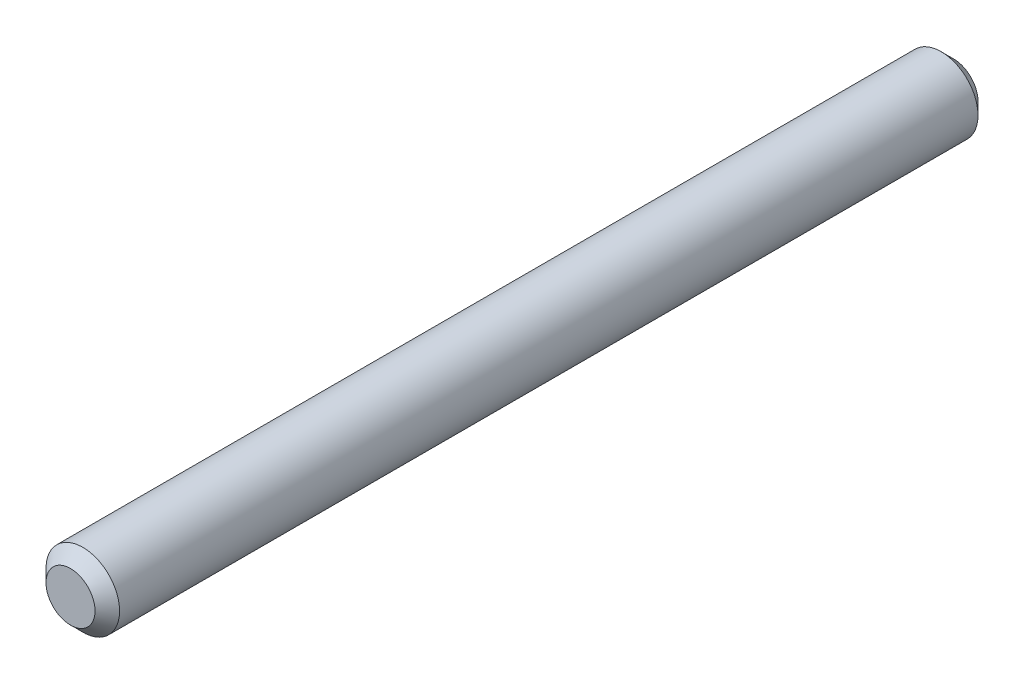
from build123d import *

# Parameters (mm, degrees)
ESQUISSE1_R      = 1.5
EXTRUSION1_DEPTH = 36
CHANFREIN1_SIZE  = 0.5


with BuildPart() as part:
    # Esquisse1 → Extrusion1 (new body)
    with BuildSketch(Plane.XY):
        Circle(ESQUISSE1_R)
    extrude(amount=EXTRUSION1_DEPTH)

    # Chanfrein1
    chanfrein1_edges = [part.edges().sort_by_distance(p)[0] for p in [
        (-1.5, 0, 0),
        (-1.5, 0, 36),
    ]]
    chamfer(chanfrein1_edges, length=CHANFREIN1_SIZE)


solid = part.part
